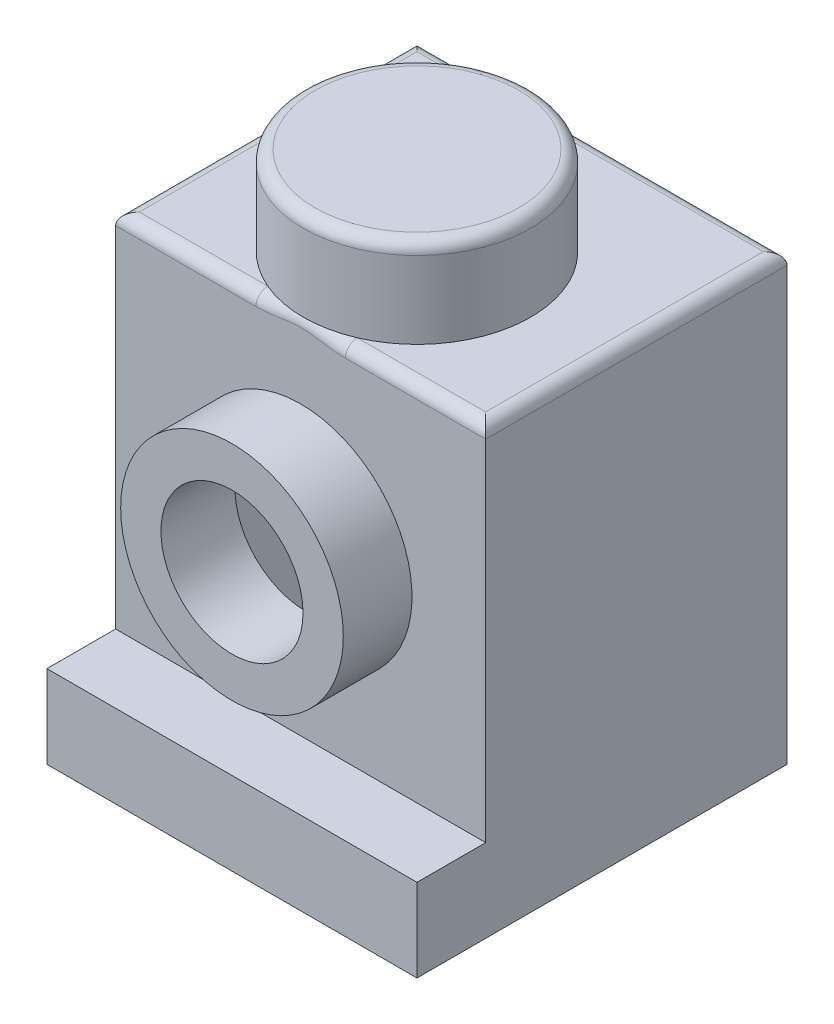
from build123d import *

# Parameters (mm, degrees)
SKETCH1_W           = 7.9375
SKETCH1_H           = 7.9375
BASE_EXTRUDE_DEPTH  = 9.525
SKETCH2_R           = 2.4384
BOSS_EXTRUDE1_DEPTH = 1.905
SKETCH3_W           = 1.4732
SKETCH3_H           = 7.747
CUT_EXTRUDE1_DEPTH  = 15.470652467
FILLET1_R           = 0.254
SKETCH4_W           = 4.7625
SKETCH4_H           = 4.7625
CUT_EXTRUDE2_DEPTH  = 7.9375
CUT_EXTRUDE3_REACH  = 16.471
SKETCH5_W           = 4.7625
SKETCH5_H           = 4.7625
SKETCH6_R           = 2.3876
BOSS_EXTRUDE2_DEPTH = 1.4732
CUT_EXTRUDE4_REACH  = 16.471
SKETCH7_R           = 1.524


with BuildPart() as part:
    # Sketch1 → Base-Extrude (new body)
    with BuildSketch(Plane(origin=(0, 0, 0), x_dir=(1, 0, 0), z_dir=(0, 1, 0))):
        Rectangle(SKETCH1_W, SKETCH1_H)
    extrude(amount=BASE_EXTRUDE_DEPTH)

    # Sketch2 → Boss-Extrude1 (add)
    with BuildSketch(Plane(origin=(0, 9.525, 0), x_dir=(-1, 0, 0), z_dir=(0, 1, 0))):
        with Locations(Location((0, 0, 0), (0, 0, 270))):
            Circle(SKETCH2_R)
    extrude(amount=BOSS_EXTRUDE1_DEPTH)

    # Sketch3 → Cut-Extrude1 (cut, through all)
    with BuildSketch(Plane(origin=(3.96875, 0, 0), x_dir=(0, 0, -1), z_dir=(1, 0, 0))):
        with Locations((-3.23215, 5.6515)):
            Rectangle(SKETCH3_W, SKETCH3_H)
    extrude(amount=-CUT_EXTRUDE1_DEPTH, mode=Mode.SUBTRACT)

    # Fillet1
    fillet1_edges = [part.edges().sort_by_distance(p)[0] for p in [
        (0, 9.525, -3.96875),
        (0, 11.43, 2.4384),
        (3.96875, 9.525, -0.7366),
        (0, 9.525, 2.49555),
        (-3.96875, 9.525, -0.7366),
    ]]
    fillet(fillet1_edges, radius=FILLET1_R)

    # Sketch4 → Cut-Extrude2 (cut)
    with BuildSketch(Plane.XZ):
        Rectangle(SKETCH4_W, SKETCH4_H)
    extrude(amount=-CUT_EXTRUDE2_DEPTH, mode=Mode.SUBTRACT)

    # Sketch5 → Cut-Extrude3 (cut, up to next)
    with BuildSketch(Plane(origin=(0, 0, -3.96875), x_dir=(-1, 0, 0), z_dir=(0, 0, -1)), mode=Mode.PRIVATE) as cut_extrude3_sk1:
        with Locations((0, 5.55625)):
            Rectangle(SKETCH5_W, SKETCH5_H)
    cut_extrude3_tool1 = extrude(cut_extrude3_sk1.sketch, amount=-CUT_EXTRUDE3_REACH, mode=Mode.PRIVATE) & part.part
    add(cut_extrude3_tool1.solids().sort_by_distance((0, 5.55625, -3.96875))[0], mode=Mode.SUBTRACT)

    # Sketch6 → Boss-Extrude2 (add)
    with BuildSketch(Plane.XY.offset(2.49555)):
        with Locations(Location((0, 5.55625, 0), (0, 0, 180))):
            Circle(SKETCH6_R)
    extrude(amount=BOSS_EXTRUDE2_DEPTH)

    # Sketch7 → Cut-Extrude4 (cut, up to next)
    with BuildSketch(Plane.XY.offset(3.96875), mode=Mode.PRIVATE) as cut_extrude4_sk1:
        with Locations((0, 5.55625)):
            Circle(SKETCH7_R)
    cut_extrude4_tool1 = extrude(cut_extrude4_sk1.sketch, amount=-CUT_EXTRUDE4_REACH, mode=Mode.PRIVATE) & part.part
    add(cut_extrude4_tool1.solids().sort_by_distance((0, 5.55625, 3.96875))[0], mode=Mode.SUBTRACT)


solid = part.part
